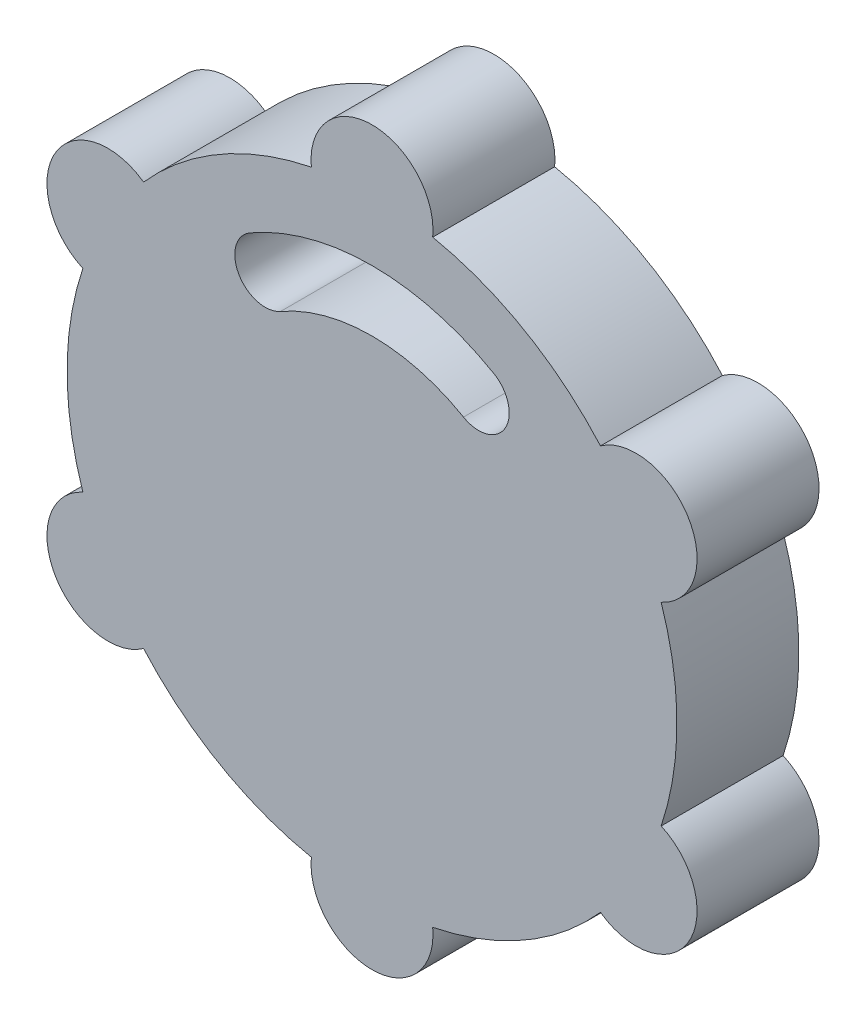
from build123d import *

# Parameters (mm, degrees)
BASE_EXTRUDE_DEPTH = 20
CUT_EXTRUDE1_DEPTH = 35


with BuildPart() as part:
    # Sketch1 → Base-Extrude (new body)
    with BuildSketch(Plane(origin=(0, 0, 0), x_dir=(0.8660254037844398, 0.49999999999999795, 0), z_dir=(0, 0, 1))):
        with BuildLine():
            ThreePointArc((49, 9.949874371), (43.301270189, 25), (33.11684397, 37.4603076))
            ThreePointArc((33.11684397, 37.4603076), (30, 51.961524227), (15.88315603, 47.410181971))
            ThreePointArc((15.88315603, 47.410181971), (0, 50), (-15.88315603, 47.410181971))
            ThreePointArc((-15.88315603, 47.410181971), (-30, 51.961524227), (-33.11684397, 37.4603076))
            ThreePointArc((-33.11684397, 37.4603076), (-43.301270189, 25), (-49, 9.949874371))
            ThreePointArc((-49, 9.949874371), (-60, 0), (-49, -9.949874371))
            ThreePointArc((-49, -9.949874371), (-43.301270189, -25), (-33.11684397, -37.4603076))
            ThreePointArc((-33.11684397, -37.4603076), (-30, -51.961524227), (-15.88315603, -47.410181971))
            ThreePointArc((-15.88315603, -47.410181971), (0, -50), (15.88315603, -47.410181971))
            ThreePointArc((15.88315603, -47.410181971), (30, -51.961524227), (33.11684397, -37.4603076))
            ThreePointArc((33.11684397, -37.4603076), (43.301270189, -25), (49, -9.949874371))
            ThreePointArc((49, -9.949874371), (60, 0), (49, 9.949874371))
        make_face()
    extrude(amount=BASE_EXTRUDE_DEPTH)

    # Sketch2 → Cut-Extrude1 (cut)
    with BuildSketch(Plane.XY.offset(20)):
        with BuildLine():
            ThreePointArc((-20, 34.641016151), (-21.830127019, 27.810889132), (-15, 25.980762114))
            ThreePointArc((-15, 25.980762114), (0, 30), (15, 25.980762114))
            ThreePointArc((15, 25.980762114), (21.830127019, 27.810889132), (20, 34.641016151))
            ThreePointArc((20, 34.641016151), (0, 40), (-20, 34.641016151))
        make_face()
    extrude(amount=-CUT_EXTRUDE1_DEPTH, mode=Mode.SUBTRACT)


solid = part.part
